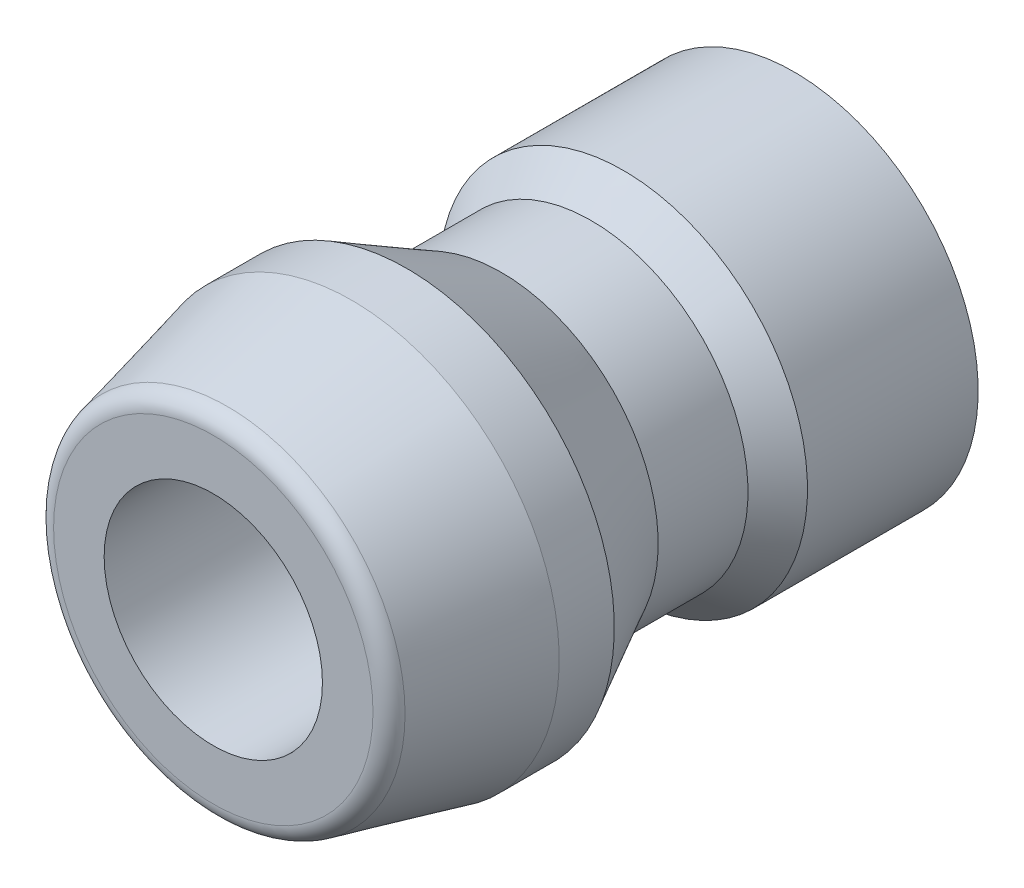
from build123d import *

# Parameters (mm, degrees)
ESQUISSE1_R             = 11.25
BASE_EXTRUSION_DEPTH    = 31.5
CONG_1_R                = 1
ESQUISSE4_R             = 5.92
ENL_V_MAT_EXTRU_2_DEPTH = 36.289871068
ENL_V_START             = 7.5
ESQUISSE5_R             = 8.5
ENL_V_MAT_EXTRU_4_DEPTH = 7.5


with BuildPart() as part:
    # Esquisse1 → Base-Extrusion (new body)
    with BuildSketch(Plane.XY):
        Circle(ESQUISSE1_R)
    extrude(amount=BASE_EXTRUSION_DEPTH)

    # Esquisse2 → Enlever de la mati_re-R_volution1 (revolve, cut)
    with BuildSketch(Plane(origin=(0, 0, 0), x_dir=(0, 0, -1), z_dir=(1, 0, 0)), mode=Mode.PRIVATE) as enlever_de_la_mati_re_r_volution1_sk:
        Polygon((0, 9.984848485), (-9.257575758, 9.984848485), (-11, 8.5), (-15.870689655, 8.5), (-21, 11.25), (-23.987983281, 11.25), (-31.5, 9.45), (-31.5, 12.356974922), (0, 12.356974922), align=None)
    revolve(enlever_de_la_mati_re_r_volution1_sk.sketch.rotate(Axis((0, 0, 0), (0, 0, 1)), 90), axis=Axis((0, 0, 0), (0, 0, 1)), mode=Mode.SUBTRACT)

    # Cong_1
    cong_1_edges = [part.edges().sort_by_distance(p)[0] for p in [
        (9.45, 0, 31.5),
    ]]
    fillet(cong_1_edges, radius=CONG_1_R)

    # Esquisse4 → Enl_v. mat.-Extru.2 (cut, through all)
    with BuildSketch(Plane.XY):
        Circle(ESQUISSE4_R)
    extrude(amount=ENL_V_MAT_EXTRU_2_DEPTH, mode=Mode.SUBTRACT)

    # Esquisse5 → Enl_v. mat.-Extru.4 (cut)
    with BuildSketch(Plane.XY.offset(ENL_V_START)):
        with Locations(Location((0, 0, 0), (0, 0, 180))):
            Circle(ESQUISSE5_R)
    extrude(amount=-ENL_V_MAT_EXTRU_4_DEPTH, mode=Mode.SUBTRACT)


solid = part.part
